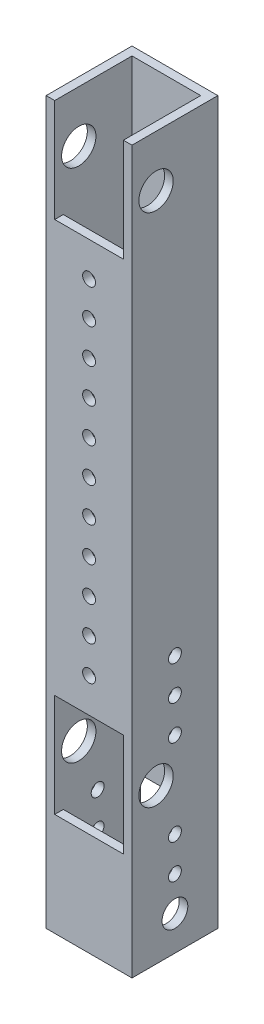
ISO-10303-21;
HEADER;
FILE_DESCRIPTION(('STEP AP214'),'2;1');
FILE_NAME('part.step','',(''),(''),'','','');
FILE_SCHEMA(('AUTOMOTIVE_DESIGN { 1 0 10303 214 1 1 1 1 }'));
ENDSEC;
DATA;
#1=APPLICATION_CONTEXT('core data for automotive mechanical design processes');
#2=APPLICATION_PROTOCOL_DEFINITION('international standard','automotive_design',2000,#1);
#3=PRODUCT_CONTEXT('',#1,'mechanical');
#4=PRODUCT('Part','Part','',(#3));
#5=PRODUCT_RELATED_PRODUCT_CATEGORY('part','',(#4));
#6=PRODUCT_DEFINITION_FORMATION('','',#4);
#7=PRODUCT_DEFINITION_CONTEXT('part definition',#1,'design');
#8=PRODUCT_DEFINITION('design','',#6,#7);
#9=PRODUCT_DEFINITION_SHAPE('','',#8);
#10=(LENGTH_UNIT() NAMED_UNIT(*) SI_UNIT(.MILLI.,.METRE.));
#11=(NAMED_UNIT(*) PLANE_ANGLE_UNIT() SI_UNIT($,.RADIAN.));
#12=(NAMED_UNIT(*) SI_UNIT($,.STERADIAN.) SOLID_ANGLE_UNIT());
#13=UNCERTAINTY_MEASURE_WITH_UNIT(LENGTH_MEASURE(1.E-05),#10,'distance_accuracy_value','');
#14=(GEOMETRIC_REPRESENTATION_CONTEXT(3) GLOBAL_UNCERTAINTY_ASSIGNED_CONTEXT((#13)) GLOBAL_UNIT_ASSIGNED_CONTEXT((#10,
#11,#12)) REPRESENTATION_CONTEXT('',''));
#15=CARTESIAN_POINT('',(0.,0.,0.));
#16=DIRECTION('',(0.,0.,1.));
#17=DIRECTION('',(1.,0.,0.));
#18=AXIS2_PLACEMENT_3D('',#15,#16,#17);
#19=CARTESIAN_POINT('',(15.875,266.7,15.875));
#20=DIRECTION('',(0.,0.,-1.));
#21=DIRECTION('',(-1.,0.,0.));
#22=AXIS2_PLACEMENT_3D('',#19,#20,#21);
#23=PLANE('',#22);
#24=CARTESIAN_POINT('',(6.66861918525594E-13,152.4,15.875));
#25=DIRECTION('',(0.,0.,1.));
#26=DIRECTION('',(1.,0.,0.));
#27=AXIS2_PLACEMENT_3D('',#24,#25,#26);
#28=CIRCLE('',#27,2.38125);
#29=CARTESIAN_POINT('',(2.38125000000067,152.4,15.875));
#30=VERTEX_POINT('',#29);
#31=EDGE_CURVE('E217',#30,#30,#28,.T.);
#32=ORIENTED_EDGE('',*,*,#31,.F.);
#33=EDGE_LOOP('',(#32));
#34=FACE_BOUND('',#33,.T.);
#35=CARTESIAN_POINT('',(7.99887357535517E-13,139.7,15.875));
#36=DIRECTION('',(0.,0.,1.));
#37=DIRECTION('',(1.,0.,0.));
#38=AXIS2_PLACEMENT_3D('',#35,#36,#37);
#39=CIRCLE('',#38,2.38125);
#40=CARTESIAN_POINT('',(2.3812500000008,139.7,15.875));
#41=VERTEX_POINT('',#40);
#42=EDGE_CURVE('E223',#41,#41,#39,.T.);
#43=ORIENTED_EDGE('',*,*,#42,.F.);
#44=EDGE_LOOP('',(#43));
#45=FACE_BOUND('',#44,.T.);
#46=CARTESIAN_POINT('',(9.32912796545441E-13,127.,15.875));
#47=DIRECTION('',(0.,0.,1.));
#48=DIRECTION('',(1.,0.,0.));
#49=AXIS2_PLACEMENT_3D('',#46,#47,#48);
#50=CIRCLE('',#49,2.38125000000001);
#51=CARTESIAN_POINT('',(2.38125000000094,127.,15.875));
#52=VERTEX_POINT('',#51);
#53=EDGE_CURVE('E229',#52,#52,#50,.T.);
#54=ORIENTED_EDGE('',*,*,#53,.F.);
#55=EDGE_LOOP('',(#54));
#56=FACE_BOUND('',#55,.T.);
#57=CARTESIAN_POINT('',(1.06593823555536E-12,114.3,15.875));
#58=DIRECTION('',(0.,0.,1.));
#59=DIRECTION('',(1.,0.,0.));
#60=AXIS2_PLACEMENT_3D('',#57,#58,#59);
#61=CIRCLE('',#60,2.38125);
#62=CARTESIAN_POINT('',(2.38125000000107,114.3,15.875));
#63=VERTEX_POINT('',#62);
#64=EDGE_CURVE('E235',#63,#63,#61,.T.);
#65=ORIENTED_EDGE('',*,*,#64,.F.);
#66=EDGE_LOOP('',(#65));
#67=FACE_BOUND('',#66,.T.);
#68=CARTESIAN_POINT('',(1.19896367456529E-12,101.6,15.875));
#69=DIRECTION('',(0.,0.,1.));
#70=DIRECTION('',(1.,0.,0.));
#71=AXIS2_PLACEMENT_3D('',#68,#69,#70);
#72=CIRCLE('',#71,2.38125);
#73=CARTESIAN_POINT('',(2.3812500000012,101.6,15.875));
#74=VERTEX_POINT('',#73);
#75=EDGE_CURVE('E241',#74,#74,#72,.T.);
#76=ORIENTED_EDGE('',*,*,#75,.F.);
#77=EDGE_LOOP('',(#76));
#78=FACE_BOUND('',#77,.T.);
#79=CARTESIAN_POINT('',(1.33198911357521E-12,88.8999999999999,15.875));
#80=DIRECTION('',(0.,0.,1.));
#81=DIRECTION('',(1.,0.,0.));
#82=AXIS2_PLACEMENT_3D('',#79,#80,#81);
#83=CIRCLE('',#82,2.38125);
#84=CARTESIAN_POINT('',(2.38125000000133,88.8999999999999,15.875));
#85=VERTEX_POINT('',#84);
#86=EDGE_CURVE('E247',#85,#85,#83,.T.);
#87=ORIENTED_EDGE('',*,*,#86,.F.);
#88=EDGE_LOOP('',(#87));
#89=FACE_BOUND('',#88,.T.);
#90=CARTESIAN_POINT('',(5.3383647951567E-13,165.1,15.875));
#91=DIRECTION('',(0.,0.,1.));
#92=DIRECTION('',(1.,0.,0.));
#93=AXIS2_PLACEMENT_3D('',#90,#91,#92);
#94=CIRCLE('',#93,2.38124999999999);
#95=CARTESIAN_POINT('',(2.38125000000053,165.1,15.875));
#96=VERTEX_POINT('',#95);
#97=EDGE_CURVE('E253',#96,#96,#94,.T.);
#98=ORIENTED_EDGE('',*,*,#97,.F.);
#99=EDGE_LOOP('',(#98));
#100=FACE_BOUND('',#99,.T.);
#101=CARTESIAN_POINT('',(4.00811040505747E-13,177.8,15.875));
#102=DIRECTION('',(0.,0.,1.));
#103=DIRECTION('',(1.,0.,0.));
#104=AXIS2_PLACEMENT_3D('',#101,#102,#103);
#105=CIRCLE('',#104,2.38125);
#106=CARTESIAN_POINT('',(2.3812500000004,177.8,15.875));
#107=VERTEX_POINT('',#106);
#108=EDGE_CURVE('E259',#107,#107,#105,.T.);
#109=ORIENTED_EDGE('',*,*,#108,.F.);
#110=EDGE_LOOP('',(#109));
#111=FACE_BOUND('',#110,.T.);
#112=CARTESIAN_POINT('',(2.67785601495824E-13,190.5,15.875));
#113=DIRECTION('',(0.,0.,1.));
#114=DIRECTION('',(1.,0.,0.));
#115=AXIS2_PLACEMENT_3D('',#112,#113,#114);
#116=CIRCLE('',#115,2.38125);
#117=CARTESIAN_POINT('',(2.38125000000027,190.5,15.875));
#118=VERTEX_POINT('',#117);
#119=EDGE_CURVE('E265',#118,#118,#116,.T.);
#120=ORIENTED_EDGE('',*,*,#119,.F.);
#121=EDGE_LOOP('',(#120));
#122=FACE_BOUND('',#121,.T.);
#123=CARTESIAN_POINT('',(1.347601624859E-13,203.2,15.875));
#124=DIRECTION('',(0.,0.,1.));
#125=DIRECTION('',(1.,0.,0.));
#126=AXIS2_PLACEMENT_3D('',#123,#124,#125);
#127=CIRCLE('',#126,2.38125);
#128=CARTESIAN_POINT('',(2.38125000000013,203.2,15.875));
#129=VERTEX_POINT('',#128);
#130=EDGE_CURVE('E271',#129,#129,#127,.T.);
#131=ORIENTED_EDGE('',*,*,#130,.F.);
#132=EDGE_LOOP('',(#131));
#133=FACE_BOUND('',#132,.T.);
#134=CARTESIAN_POINT('',(0.,215.9,15.875));
#135=DIRECTION('',(0.,0.,1.));
#136=DIRECTION('',(1.,0.,0.));
#137=AXIS2_PLACEMENT_3D('',#134,#135,#136);
#138=CIRCLE('',#137,2.38125);
#139=CARTESIAN_POINT('',(2.38125,215.9,15.875));
#140=VERTEX_POINT('',#139);
#141=EDGE_CURVE('E277',#140,#140,#138,.T.);
#142=ORIENTED_EDGE('',*,*,#141,.F.);
#143=EDGE_LOOP('',(#142));
#144=FACE_BOUND('',#143,.T.);
#145=DIRECTION('',(0.,1.,0.));
#146=VECTOR('',#145,1.);
#147=CARTESIAN_POINT('',(-12.7,0.,15.875));
#148=LINE('',#147,#146);
#149=CARTESIAN_POINT('',(-12.7,38.1,15.875));
#150=VERTEX_POINT('',#149);
#151=CARTESIAN_POINT('',(-12.7,76.2,15.875));
#152=VERTEX_POINT('',#151);
#153=EDGE_CURVE('E299',#150,#152,#148,.T.);
#154=ORIENTED_EDGE('',*,*,#153,.T.);
#155=DIRECTION('',(-1.,0.,0.));
#156=VECTOR('',#155,1.);
#157=CARTESIAN_POINT('',(0.,76.2,15.875));
#158=LINE('',#157,#156);
#159=CARTESIAN_POINT('',(12.7,76.2,15.875));
#160=VERTEX_POINT('',#159);
#161=EDGE_CURVE('E308',#160,#152,#158,.T.);
#162=ORIENTED_EDGE('',*,*,#161,.F.);
#163=DIRECTION('',(0.,1.,0.));
#164=VECTOR('',#163,1.);
#165=CARTESIAN_POINT('',(12.7,0.,15.875));
#166=LINE('',#165,#164);
#167=CARTESIAN_POINT('',(12.7,38.1,15.875));
#168=VERTEX_POINT('',#167);
#169=EDGE_CURVE('E305',#168,#160,#166,.T.);
#170=ORIENTED_EDGE('',*,*,#169,.F.);
#171=DIRECTION('',(-1.,0.,0.));
#172=VECTOR('',#171,1.);
#173=CARTESIAN_POINT('',(0.,38.1,15.875));
#174=LINE('',#173,#172);
#175=EDGE_CURVE('E302',#168,#150,#174,.T.);
#176=ORIENTED_EDGE('',*,*,#175,.T.);
#177=EDGE_LOOP('',(#154,#162,#170,#176));
#178=FACE_BOUND('',#177,.T.);
#179=DIRECTION('',(0.,1.,0.));
#180=VECTOR('',#179,1.);
#181=CARTESIAN_POINT('',(-12.7,0.,15.875));
#182=LINE('',#181,#180);
#183=CARTESIAN_POINT('',(-12.7,228.6,15.875));
#184=VERTEX_POINT('',#183);
#185=CARTESIAN_POINT('',(-12.7,266.7,15.875));
#186=VERTEX_POINT('',#185);
#187=EDGE_CURVE('E292',#184,#186,#182,.T.);
#188=ORIENTED_EDGE('',*,*,#187,.T.);
#189=DIRECTION('',(1.,0.,0.));
#190=VECTOR('',#189,1.);
#191=CARTESIAN_POINT('',(15.875,266.7,15.875));
#192=LINE('',#191,#190);
#193=CARTESIAN_POINT('',(-15.875,266.7,15.875));
#194=VERTEX_POINT('',#193);
#195=EDGE_CURVE('E449',#194,#186,#192,.T.);
#196=ORIENTED_EDGE('',*,*,#195,.F.);
#197=DIRECTION('',(0.,-1.,0.));
#198=VECTOR('',#197,1.);
#199=CARTESIAN_POINT('',(-15.875,266.7,15.875));
#200=LINE('',#199,#198);
#201=CARTESIAN_POINT('',(-15.875,0.,15.875));
#202=VERTEX_POINT('',#201);
#203=EDGE_CURVE('E474',#194,#202,#200,.T.);
#204=ORIENTED_EDGE('',*,*,#203,.T.);
#205=DIRECTION('',(1.,0.,0.));
#206=VECTOR('',#205,1.);
#207=CARTESIAN_POINT('',(15.875,0.,15.875));
#208=LINE('',#207,#206);
#209=CARTESIAN_POINT('',(15.875,0.,15.875));
#210=VERTEX_POINT('',#209);
#211=EDGE_CURVE('E459',#202,#210,#208,.T.);
#212=ORIENTED_EDGE('',*,*,#211,.T.);
#213=DIRECTION('',(0.,-1.,0.));
#214=VECTOR('',#213,1.);
#215=CARTESIAN_POINT('',(15.875,266.7,15.875));
#216=LINE('',#215,#214);
#217=CARTESIAN_POINT('',(15.875,266.7,15.875));
#218=VERTEX_POINT('',#217);
#219=EDGE_CURVE('E471',#218,#210,#216,.T.);
#220=ORIENTED_EDGE('',*,*,#219,.F.);
#221=CARTESIAN_POINT('',(12.7,266.7,15.875));
#222=VERTEX_POINT('',#221);
#223=EDGE_CURVE('E447',#222,#218,#192,.T.);
#224=ORIENTED_EDGE('',*,*,#223,.F.);
#225=DIRECTION('',(0.,1.,0.));
#226=VECTOR('',#225,1.);
#227=CARTESIAN_POINT('',(12.7,0.,15.875));
#228=LINE('',#227,#226);
#229=CARTESIAN_POINT('',(12.7,228.6,15.875));
#230=VERTEX_POINT('',#229);
#231=EDGE_CURVE('E285',#230,#222,#228,.T.);
#232=ORIENTED_EDGE('',*,*,#231,.F.);
#233=DIRECTION('',(-1.,0.,0.));
#234=VECTOR('',#233,1.);
#235=CARTESIAN_POINT('',(2.4980018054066E-13,228.6,15.875));
#236=LINE('',#235,#234);
#237=EDGE_CURVE('E288',#230,#184,#236,.T.);
#238=ORIENTED_EDGE('',*,*,#237,.T.);
#239=EDGE_LOOP('',(#188,#196,#204,#212,#220,#224,#232,#238));
#240=FACE_BOUND('',#239,.T.);
#241=ADVANCED_FACE('F39',(#34,#45,#56,#67,#78,#89,#100,#111,#122,#133,#144,#178,#240),#23,.F.);
#242=CARTESIAN_POINT('',(12.7,266.7,12.7));
#243=DIRECTION('',(0.,0.,-1.));
#244=DIRECTION('',(-1.,0.,0.));
#245=AXIS2_PLACEMENT_3D('',#242,#243,#244);
#246=PLANE('',#245);
#247=CARTESIAN_POINT('',(6.66861918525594E-13,152.4,12.7));
#248=DIRECTION('',(0.,0.,-1.));
#249=DIRECTION('',(-1.,0.,0.));
#250=AXIS2_PLACEMENT_3D('',#247,#248,#249);
#251=CIRCLE('',#250,2.38125);
#252=CARTESIAN_POINT('',(-2.38124999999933,152.4,12.7));
#253=VERTEX_POINT('',#252);
#254=EDGE_CURVE('E214',#253,#253,#251,.F.);
#255=ORIENTED_EDGE('',*,*,#254,.T.);
#256=EDGE_LOOP('',(#255));
#257=FACE_BOUND('',#256,.T.);
#258=CARTESIAN_POINT('',(7.99887357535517E-13,139.7,12.7));
#259=DIRECTION('',(0.,0.,-1.));
#260=DIRECTION('',(-1.,0.,0.));
#261=AXIS2_PLACEMENT_3D('',#258,#259,#260);
#262=CIRCLE('',#261,2.38125);
#263=CARTESIAN_POINT('',(-2.3812499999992,139.7,12.7));
#264=VERTEX_POINT('',#263);
#265=EDGE_CURVE('E220',#264,#264,#262,.F.);
#266=ORIENTED_EDGE('',*,*,#265,.T.);
#267=EDGE_LOOP('',(#266));
#268=FACE_BOUND('',#267,.T.);
#269=CARTESIAN_POINT('',(9.32912796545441E-13,127.,12.7));
#270=DIRECTION('',(0.,0.,-1.));
#271=DIRECTION('',(-1.,0.,0.));
#272=AXIS2_PLACEMENT_3D('',#269,#270,#271);
#273=CIRCLE('',#272,2.38125000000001);
#274=CARTESIAN_POINT('',(-2.38124999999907,127.,12.7));
#275=VERTEX_POINT('',#274);
#276=EDGE_CURVE('E226',#275,#275,#273,.F.);
#277=ORIENTED_EDGE('',*,*,#276,.T.);
#278=EDGE_LOOP('',(#277));
#279=FACE_BOUND('',#278,.T.);
#280=CARTESIAN_POINT('',(1.06593823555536E-12,114.3,12.7));
#281=DIRECTION('',(0.,0.,-1.));
#282=DIRECTION('',(-1.,0.,0.));
#283=AXIS2_PLACEMENT_3D('',#280,#281,#282);
#284=CIRCLE('',#283,2.38125);
#285=CARTESIAN_POINT('',(-2.38124999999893,114.3,12.7));
#286=VERTEX_POINT('',#285);
#287=EDGE_CURVE('E232',#286,#286,#284,.F.);
#288=ORIENTED_EDGE('',*,*,#287,.T.);
#289=EDGE_LOOP('',(#288));
#290=FACE_BOUND('',#289,.T.);
#291=CARTESIAN_POINT('',(1.19896367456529E-12,101.6,12.7));
#292=DIRECTION('',(0.,0.,-1.));
#293=DIRECTION('',(-1.,0.,0.));
#294=AXIS2_PLACEMENT_3D('',#291,#292,#293);
#295=CIRCLE('',#294,2.38125);
#296=CARTESIAN_POINT('',(-2.3812499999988,101.6,12.7));
#297=VERTEX_POINT('',#296);
#298=EDGE_CURVE('E238',#297,#297,#295,.F.);
#299=ORIENTED_EDGE('',*,*,#298,.T.);
#300=EDGE_LOOP('',(#299));
#301=FACE_BOUND('',#300,.T.);
#302=CARTESIAN_POINT('',(1.33198911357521E-12,88.8999999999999,12.7));
#303=DIRECTION('',(0.,0.,-1.));
#304=DIRECTION('',(-1.,0.,0.));
#305=AXIS2_PLACEMENT_3D('',#302,#303,#304);
#306=CIRCLE('',#305,2.38125);
#307=CARTESIAN_POINT('',(-2.38124999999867,88.8999999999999,12.7));
#308=VERTEX_POINT('',#307);
#309=EDGE_CURVE('E244',#308,#308,#306,.F.);
#310=ORIENTED_EDGE('',*,*,#309,.T.);
#311=EDGE_LOOP('',(#310));
#312=FACE_BOUND('',#311,.T.);
#313=CARTESIAN_POINT('',(5.3383647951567E-13,165.1,12.7));
#314=DIRECTION('',(0.,0.,-1.));
#315=DIRECTION('',(-1.,0.,0.));
#316=AXIS2_PLACEMENT_3D('',#313,#314,#315);
#317=CIRCLE('',#316,2.38124999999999);
#318=CARTESIAN_POINT('',(-2.38124999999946,165.1,12.7));
#319=VERTEX_POINT('',#318);
#320=EDGE_CURVE('E250',#319,#319,#317,.F.);
#321=ORIENTED_EDGE('',*,*,#320,.T.);
#322=EDGE_LOOP('',(#321));
#323=FACE_BOUND('',#322,.T.);
#324=CARTESIAN_POINT('',(4.00811040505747E-13,177.8,12.7));
#325=DIRECTION('',(0.,0.,-1.));
#326=DIRECTION('',(-1.,0.,0.));
#327=AXIS2_PLACEMENT_3D('',#324,#325,#326);
#328=CIRCLE('',#327,2.38125);
#329=CARTESIAN_POINT('',(-2.3812499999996,177.8,12.7));
#330=VERTEX_POINT('',#329);
#331=EDGE_CURVE('E256',#330,#330,#328,.F.);
#332=ORIENTED_EDGE('',*,*,#331,.T.);
#333=EDGE_LOOP('',(#332));
#334=FACE_BOUND('',#333,.T.);
#335=CARTESIAN_POINT('',(2.67785601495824E-13,190.5,12.7));
#336=DIRECTION('',(0.,0.,-1.));
#337=DIRECTION('',(-1.,0.,0.));
#338=AXIS2_PLACEMENT_3D('',#335,#336,#337);
#339=CIRCLE('',#338,2.38125);
#340=CARTESIAN_POINT('',(-2.38124999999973,190.5,12.7));
#341=VERTEX_POINT('',#340);
#342=EDGE_CURVE('E262',#341,#341,#339,.F.);
#343=ORIENTED_EDGE('',*,*,#342,.T.);
#344=EDGE_LOOP('',(#343));
#345=FACE_BOUND('',#344,.T.);
#346=CARTESIAN_POINT('',(1.347601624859E-13,203.2,12.7));
#347=DIRECTION('',(0.,0.,-1.));
#348=DIRECTION('',(-1.,0.,0.));
#349=AXIS2_PLACEMENT_3D('',#346,#347,#348);
#350=CIRCLE('',#349,2.38125);
#351=CARTESIAN_POINT('',(-2.38124999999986,203.2,12.7));
#352=VERTEX_POINT('',#351);
#353=EDGE_CURVE('E268',#352,#352,#350,.F.);
#354=ORIENTED_EDGE('',*,*,#353,.T.);
#355=EDGE_LOOP('',(#354));
#356=FACE_BOUND('',#355,.T.);
#357=CARTESIAN_POINT('',(0.,215.9,12.7));
#358=DIRECTION('',(0.,0.,-1.));
#359=DIRECTION('',(-1.,0.,0.));
#360=AXIS2_PLACEMENT_3D('',#357,#358,#359);
#361=CIRCLE('',#360,2.38125);
#362=CARTESIAN_POINT('',(-2.38125,215.9,12.7));
#363=VERTEX_POINT('',#362);
#364=EDGE_CURVE('E274',#363,#363,#361,.F.);
#365=ORIENTED_EDGE('',*,*,#364,.T.);
#366=EDGE_LOOP('',(#365));
#367=FACE_BOUND('',#366,.T.);
#368=DIRECTION('',(0.,-1.,0.));
#369=VECTOR('',#368,1.);
#370=CARTESIAN_POINT('',(-12.7,266.7,12.7));
#371=LINE('',#370,#369);
#372=CARTESIAN_POINT('',(-12.7,228.6,12.7));
#373=VERTEX_POINT('',#372);
#374=CARTESIAN_POINT('',(-12.7,76.2,12.7));
#375=VERTEX_POINT('',#374);
#376=EDGE_CURVE('E441',#373,#375,#371,.T.);
#377=ORIENTED_EDGE('',*,*,#376,.F.);
#378=DIRECTION('',(-1.,0.,0.));
#379=VECTOR('',#378,1.);
#380=CARTESIAN_POINT('',(2.4980018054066E-13,228.6,12.7));
#381=LINE('',#380,#379);
#382=CARTESIAN_POINT('',(12.7,228.6,12.7));
#383=VERTEX_POINT('',#382);
#384=EDGE_CURVE('E281',#383,#373,#381,.T.);
#385=ORIENTED_EDGE('',*,*,#384,.F.);
#386=DIRECTION('',(0.,-1.,0.));
#387=VECTOR('',#386,1.);
#388=CARTESIAN_POINT('',(12.7,266.7,12.7));
#389=LINE('',#388,#387);
#390=CARTESIAN_POINT('',(12.7,76.2,12.7));
#391=VERTEX_POINT('',#390);
#392=EDGE_CURVE('E438',#383,#391,#389,.T.);
#393=ORIENTED_EDGE('',*,*,#392,.T.);
#394=DIRECTION('',(-1.,0.,0.));
#395=VECTOR('',#394,1.);
#396=CARTESIAN_POINT('',(0.,76.2,12.7));
#397=LINE('',#396,#395);
#398=EDGE_CURVE('E284',#391,#375,#397,.T.);
#399=ORIENTED_EDGE('',*,*,#398,.T.);
#400=EDGE_LOOP('',(#377,#385,#393,#399));
#401=FACE_BOUND('',#400,.T.);
#402=ADVANCED_FACE('F570',(#257,#268,#279,#290,#301,#312,#323,#334,#345,#356,#367,#401),#246,.T.);
#403=CARTESIAN_POINT('',(0.,266.7,0.));
#404=DIRECTION('',(0.,1.,0.));
#405=DIRECTION('',(0.,0.,1.));
#406=AXIS2_PLACEMENT_3D('',#403,#404,#405);
#407=PLANE('',#406);
#408=ORIENTED_EDGE('',*,*,#195,.T.);
#409=DIRECTION('',(0.,0.,1.));
#410=VECTOR('',#409,1.);
#411=CARTESIAN_POINT('',(-12.7,266.7,12.7));
#412=LINE('',#411,#410);
#413=CARTESIAN_POINT('',(-12.7,266.7,-12.7));
#414=VERTEX_POINT('',#413);
#415=EDGE_CURVE('E417',#414,#186,#412,.T.);
#416=ORIENTED_EDGE('',*,*,#415,.F.);
#417=DIRECTION('',(-1.,0.,0.));
#418=VECTOR('',#417,1.);
#419=CARTESIAN_POINT('',(12.7,266.7,-12.7));
#420=LINE('',#419,#418);
#421=CARTESIAN_POINT('',(12.7,266.7,-12.7));
#422=VERTEX_POINT('',#421);
#423=EDGE_CURVE('E423',#422,#414,#420,.T.);
#424=ORIENTED_EDGE('',*,*,#423,.F.);
#425=DIRECTION('',(0.,0.,-1.));
#426=VECTOR('',#425,1.);
#427=CARTESIAN_POINT('',(12.7,266.7,12.7));
#428=LINE('',#427,#426);
#429=EDGE_CURVE('E419',#222,#422,#428,.T.);
#430=ORIENTED_EDGE('',*,*,#429,.F.);
#431=ORIENTED_EDGE('',*,*,#223,.T.);
#432=DIRECTION('',(0.,0.,-1.));
#433=VECTOR('',#432,1.);
#434=CARTESIAN_POINT('',(15.875,266.7,15.875));
#435=LINE('',#434,#433);
#436=CARTESIAN_POINT('',(15.875,266.7,-15.875));
#437=VERTEX_POINT('',#436);
#438=EDGE_CURVE('E452',#218,#437,#435,.T.);
#439=ORIENTED_EDGE('',*,*,#438,.T.);
#440=DIRECTION('',(-1.,0.,0.));
#441=VECTOR('',#440,1.);
#442=CARTESIAN_POINT('',(15.875,266.7,-15.875));
#443=LINE('',#442,#441);
#444=CARTESIAN_POINT('',(-15.875,266.7,-15.875));
#445=VERTEX_POINT('',#444);
#446=EDGE_CURVE('E454',#437,#445,#443,.T.);
#447=ORIENTED_EDGE('',*,*,#446,.T.);
#448=DIRECTION('',(0.,0.,1.));
#449=VECTOR('',#448,1.);
#450=CARTESIAN_POINT('',(-15.875,266.7,15.875));
#451=LINE('',#450,#449);
#452=EDGE_CURVE('E444',#445,#194,#451,.T.);
#453=ORIENTED_EDGE('',*,*,#452,.T.);
#454=EDGE_LOOP('',(#408,#416,#424,#430,#431,#439,#447,#453));
#455=FACE_BOUND('',#454,.T.);
#456=ADVANCED_FACE('F556',(#455),#407,.T.);
#457=CARTESIAN_POINT('',(-15.875,247.65,6.985));
#458=DIRECTION('',(1.,0.,0.));
#459=DIRECTION('',(0.,0.,-1.));
#460=AXIS2_PLACEMENT_3D('',#457,#458,#459);
#461=CYLINDRICAL_SURFACE('',#460,6.34999999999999);
#462=CARTESIAN_POINT('',(-15.875,247.65,6.985));
#463=DIRECTION('',(1.,0.,0.));
#464=DIRECTION('',(0.,0.,-1.));
#465=AXIS2_PLACEMENT_3D('',#462,#463,#464);
#466=CIRCLE('',#465,6.34999999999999);
#467=CARTESIAN_POINT('',(-15.875,247.65,0.635000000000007));
#468=VERTEX_POINT('',#467);
#469=EDGE_CURVE('E408',#468,#468,#466,.T.);
#470=ORIENTED_EDGE('',*,*,#469,.F.);
#471=EDGE_LOOP('',(#470));
#472=FACE_BOUND('',#471,.T.);
#473=CARTESIAN_POINT('',(-12.7,247.65,6.985));
#474=DIRECTION('',(1.,0.,0.));
#475=DIRECTION('',(0.,0.,-1.));
#476=AXIS2_PLACEMENT_3D('',#473,#474,#475);
#477=CIRCLE('',#476,6.34999999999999);
#478=CARTESIAN_POINT('',(-12.7,247.65,0.635000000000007));
#479=VERTEX_POINT('',#478);
#480=EDGE_CURVE('E411',#479,#479,#477,.T.);
#481=ORIENTED_EDGE('',*,*,#480,.T.);
#482=EDGE_LOOP('',(#481));
#483=FACE_BOUND('',#482,.T.);
#484=ADVANCED_FACE('F585',(#472,#483),#461,.F.);
#485=CARTESIAN_POINT('',(-12.7,38.1,12.7));
#486=VERTEX_POINT('',#485);
#487=CARTESIAN_POINT('',(-12.7,0.,12.7));
#488=VERTEX_POINT('',#487);
#489=EDGE_CURVE('E440',#486,#488,#371,.T.);
#490=ORIENTED_EDGE('',*,*,#489,.F.);
#491=DIRECTION('',(-1.,0.,0.));
#492=VECTOR('',#491,1.);
#493=CARTESIAN_POINT('',(0.,38.1,12.7));
#494=LINE('',#493,#492);
#495=CARTESIAN_POINT('',(12.7,38.1,12.7));
#496=VERTEX_POINT('',#495);
#497=EDGE_CURVE('E314',#496,#486,#494,.T.);
#498=ORIENTED_EDGE('',*,*,#497,.F.);
#499=CARTESIAN_POINT('',(12.7,0.,12.7));
#500=VERTEX_POINT('',#499);
#501=EDGE_CURVE('E437',#496,#500,#389,.T.);
#502=ORIENTED_EDGE('',*,*,#501,.T.);
#503=DIRECTION('',(1.,0.,0.));
#504=VECTOR('',#503,1.);
#505=CARTESIAN_POINT('',(12.7,0.,12.7));
#506=LINE('',#505,#504);
#507=EDGE_CURVE('E428',#488,#500,#506,.T.);
#508=ORIENTED_EDGE('',*,*,#507,.F.);
#509=EDGE_LOOP('',(#490,#498,#502,#508));
#510=FACE_BOUND('',#509,.T.);
#511=ADVANCED_FACE('F583',(#510),#246,.T.);
#512=CARTESIAN_POINT('',(-15.875,57.15,6.985));
#513=DIRECTION('',(1.,0.,0.));
#514=DIRECTION('',(0.,0.,-1.));
#515=AXIS2_PLACEMENT_3D('',#512,#513,#514);
#516=CYLINDRICAL_SURFACE('',#515,6.35);
#517=CARTESIAN_POINT('',(-15.875,57.15,6.985));
#518=DIRECTION('',(1.,0.,0.));
#519=DIRECTION('',(0.,0.,-1.));
#520=AXIS2_PLACEMENT_3D('',#517,#518,#519);
#521=CIRCLE('',#520,6.35);
#522=CARTESIAN_POINT('',(-15.875,57.15,0.635));
#523=VERTEX_POINT('',#522);
#524=EDGE_CURVE('E399',#523,#523,#521,.T.);
#525=ORIENTED_EDGE('',*,*,#524,.F.);
#526=EDGE_LOOP('',(#525));
#527=FACE_BOUND('',#526,.T.);
#528=CARTESIAN_POINT('',(-12.7,57.15,6.985));
#529=DIRECTION('',(1.,0.,0.));
#530=DIRECTION('',(0.,0.,-1.));
#531=AXIS2_PLACEMENT_3D('',#528,#529,#530);
#532=CIRCLE('',#531,6.35);
#533=CARTESIAN_POINT('',(-12.7,57.15,0.635));
#534=VERTEX_POINT('',#533);
#535=EDGE_CURVE('E402',#534,#534,#532,.T.);
#536=ORIENTED_EDGE('',*,*,#535,.T.);
#537=EDGE_LOOP('',(#536));
#538=FACE_BOUND('',#537,.T.);
#539=ADVANCED_FACE('F514',(#527,#538),#516,.F.);
#540=CARTESIAN_POINT('',(0.,0.,0.));
#541=DIRECTION('',(0.,1.,0.));
#542=DIRECTION('',(0.,0.,1.));
#543=AXIS2_PLACEMENT_3D('',#540,#541,#542);
#544=PLANE('',#543);
#545=DIRECTION('',(-1.,0.,0.));
#546=VECTOR('',#545,1.);
#547=CARTESIAN_POINT('',(15.875,0.,-15.875));
#548=LINE('',#547,#546);
#549=CARTESIAN_POINT('',(-12.7,0.,-15.875));
#550=VERTEX_POINT('',#549);
#551=CARTESIAN_POINT('',(-15.875,0.,-15.875));
#552=VERTEX_POINT('',#551);
#553=EDGE_CURVE('E463',#550,#552,#548,.T.);
#554=ORIENTED_EDGE('',*,*,#553,.F.);
#555=DIRECTION('',(0.,0.,1.));
#556=VECTOR('',#555,1.);
#557=CARTESIAN_POINT('',(-12.7,0.,12.7));
#558=LINE('',#557,#556);
#559=EDGE_CURVE('E416',#550,#488,#558,.T.);
#560=ORIENTED_EDGE('',*,*,#559,.T.);
#561=ORIENTED_EDGE('',*,*,#507,.T.);
#562=DIRECTION('',(0.,0.,-1.));
#563=VECTOR('',#562,1.);
#564=CARTESIAN_POINT('',(12.7,0.,12.7));
#565=LINE('',#564,#563);
#566=CARTESIAN_POINT('',(12.7,0.,-15.875));
#567=VERTEX_POINT('',#566);
#568=EDGE_CURVE('E420',#500,#567,#565,.T.);
#569=ORIENTED_EDGE('',*,*,#568,.T.);
#570=CARTESIAN_POINT('',(15.875,0.,-15.875));
#571=VERTEX_POINT('',#570);
#572=EDGE_CURVE('E448',#571,#567,#548,.T.);
#573=ORIENTED_EDGE('',*,*,#572,.F.);
#574=DIRECTION('',(0.,0.,-1.));
#575=VECTOR('',#574,1.);
#576=CARTESIAN_POINT('',(15.875,0.,15.875));
#577=LINE('',#576,#575);
#578=EDGE_CURVE('E461',#210,#571,#577,.T.);
#579=ORIENTED_EDGE('',*,*,#578,.F.);
#580=ORIENTED_EDGE('',*,*,#211,.F.);
#581=DIRECTION('',(0.,0.,1.));
#582=VECTOR('',#581,1.);
#583=CARTESIAN_POINT('',(-15.875,0.,15.875));
#584=LINE('',#583,#582);
#585=EDGE_CURVE('E443',#552,#202,#584,.T.);
#586=ORIENTED_EDGE('',*,*,#585,.F.);
#587=EDGE_LOOP('',(#554,#560,#561,#569,#573,#579,#580,#586));
#588=FACE_BOUND('',#587,.T.);
#589=ADVANCED_FACE('F537',(#588),#544,.F.);
#590=CARTESIAN_POINT('',(-15.875,266.7,15.875));
#591=DIRECTION('',(1.,0.,0.));
#592=DIRECTION('',(0.,0.,-1.));
#593=AXIS2_PLACEMENT_3D('',#590,#591,#592);
#594=PLANE('',#593);
#595=CARTESIAN_POINT('',(-15.875,95.25,0.));
#596=DIRECTION('',(1.,0.,0.));
#597=DIRECTION('',(0.,0.,-1.));
#598=AXIS2_PLACEMENT_3D('',#595,#596,#597);
#599=CIRCLE('',#598,2.38125);
#600=CARTESIAN_POINT('',(-15.875,95.25,-2.38125));
#601=VERTEX_POINT('',#600);
#602=EDGE_CURVE('E340',#601,#601,#599,.T.);
#603=ORIENTED_EDGE('',*,*,#602,.T.);
#604=EDGE_LOOP('',(#603));
#605=FACE_BOUND('',#604,.T.);
#606=CARTESIAN_POINT('',(-15.875,82.55,0.));
#607=DIRECTION('',(1.,0.,0.));
#608=DIRECTION('',(0.,0.,-1.));
#609=AXIS2_PLACEMENT_3D('',#606,#607,#608);
#610=CIRCLE('',#609,2.38125);
#611=CARTESIAN_POINT('',(-15.875,82.55,-2.38125));
#612=VERTEX_POINT('',#611);
#613=EDGE_CURVE('E349',#612,#612,#610,.T.);
#614=ORIENTED_EDGE('',*,*,#613,.T.);
#615=EDGE_LOOP('',(#614));
#616=FACE_BOUND('',#615,.T.);
#617=CARTESIAN_POINT('',(-15.875,69.85,0.));
#618=DIRECTION('',(1.,0.,0.));
#619=DIRECTION('',(0.,0.,-1.));
#620=AXIS2_PLACEMENT_3D('',#617,#618,#619);
#621=CIRCLE('',#620,2.38125);
#622=CARTESIAN_POINT('',(-15.875,69.85,-2.38125));
#623=VERTEX_POINT('',#622);
#624=EDGE_CURVE('E359',#623,#623,#621,.T.);
#625=ORIENTED_EDGE('',*,*,#624,.T.);
#626=EDGE_LOOP('',(#625));
#627=FACE_BOUND('',#626,.T.);
#628=CARTESIAN_POINT('',(-15.875,38.1,0.));
#629=DIRECTION('',(1.,0.,0.));
#630=DIRECTION('',(0.,0.,-1.));
#631=AXIS2_PLACEMENT_3D('',#628,#629,#630);
#632=CIRCLE('',#631,2.38125);
#633=CARTESIAN_POINT('',(-15.875,38.1,-2.38125));
#634=VERTEX_POINT('',#633);
#635=EDGE_CURVE('E369',#634,#634,#632,.T.);
#636=ORIENTED_EDGE('',*,*,#635,.T.);
#637=EDGE_LOOP('',(#636));
#638=FACE_BOUND('',#637,.T.);
#639=CARTESIAN_POINT('',(-15.875,25.4,0.));
#640=DIRECTION('',(1.,0.,0.));
#641=DIRECTION('',(0.,0.,-1.));
#642=AXIS2_PLACEMENT_3D('',#639,#640,#641);
#643=CIRCLE('',#642,2.38125);
#644=CARTESIAN_POINT('',(-15.875,25.4,-2.38125));
#645=VERTEX_POINT('',#644);
#646=EDGE_CURVE('E379',#645,#645,#643,.T.);
#647=ORIENTED_EDGE('',*,*,#646,.T.);
#648=EDGE_LOOP('',(#647));
#649=FACE_BOUND('',#648,.T.);
#650=CARTESIAN_POINT('',(-15.875,12.7,0.));
#651=DIRECTION('',(1.,0.,0.));
#652=DIRECTION('',(0.,0.,-1.));
#653=AXIS2_PLACEMENT_3D('',#650,#651,#652);
#654=CIRCLE('',#653,4.7625);
#655=CARTESIAN_POINT('',(-15.875,12.7,-4.7625));
#656=VERTEX_POINT('',#655);
#657=EDGE_CURVE('E389',#656,#656,#654,.T.);
#658=ORIENTED_EDGE('',*,*,#657,.T.);
#659=EDGE_LOOP('',(#658));
#660=FACE_BOUND('',#659,.T.);
#661=ORIENTED_EDGE('',*,*,#524,.T.);
#662=EDGE_LOOP('',(#661));
#663=FACE_BOUND('',#662,.T.);
#664=ORIENTED_EDGE('',*,*,#469,.T.);
#665=EDGE_LOOP('',(#664));
#666=FACE_BOUND('',#665,.T.);
#667=ORIENTED_EDGE('',*,*,#585,.T.);
#668=ORIENTED_EDGE('',*,*,#203,.F.);
#669=ORIENTED_EDGE('',*,*,#452,.F.);
#670=DIRECTION('',(0.,-1.,0.));
#671=VECTOR('',#670,1.);
#672=CARTESIAN_POINT('',(-15.875,266.7,-15.875));
#673=LINE('',#672,#671);
#674=EDGE_CURVE('E456',#445,#552,#673,.T.);
#675=ORIENTED_EDGE('',*,*,#674,.T.);
#676=EDGE_LOOP('',(#667,#668,#669,#675));
#677=FACE_BOUND('',#676,.T.);
#678=ADVANCED_FACE('F41',(#605,#616,#627,#638,#649,#660,#663,#666,#677),#594,.F.);
#679=CARTESIAN_POINT('',(15.875,266.7,15.875));
#680=DIRECTION('',(-1.,0.,0.));
#681=DIRECTION('',(0.,0.,1.));
#682=AXIS2_PLACEMENT_3D('',#679,#680,#681);
#683=PLANE('',#682);
#684=CARTESIAN_POINT('',(15.875,95.25,0.));
#685=DIRECTION('',(1.,0.,0.));
#686=DIRECTION('',(0.,0.,-1.));
#687=AXIS2_PLACEMENT_3D('',#684,#685,#686);
#688=CIRCLE('',#687,2.38125);
#689=CARTESIAN_POINT('',(15.875,95.25,-2.38125));
#690=VERTEX_POINT('',#689);
#691=EDGE_CURVE('E338',#690,#690,#688,.T.);
#692=ORIENTED_EDGE('',*,*,#691,.F.);
#693=EDGE_LOOP('',(#692));
#694=FACE_BOUND('',#693,.T.);
#695=CARTESIAN_POINT('',(15.875,82.55,0.));
#696=DIRECTION('',(1.,0.,0.));
#697=DIRECTION('',(0.,0.,-1.));
#698=AXIS2_PLACEMENT_3D('',#695,#696,#697);
#699=CIRCLE('',#698,2.38125);
#700=CARTESIAN_POINT('',(15.875,82.55,-2.38125));
#701=VERTEX_POINT('',#700);
#702=EDGE_CURVE('E348',#701,#701,#699,.T.);
#703=ORIENTED_EDGE('',*,*,#702,.F.);
#704=EDGE_LOOP('',(#703));
#705=FACE_BOUND('',#704,.T.);
#706=CARTESIAN_POINT('',(15.875,69.85,0.));
#707=DIRECTION('',(1.,0.,0.));
#708=DIRECTION('',(0.,0.,-1.));
#709=AXIS2_PLACEMENT_3D('',#706,#707,#708);
#710=CIRCLE('',#709,2.38125);
#711=CARTESIAN_POINT('',(15.875,69.85,-2.38125));
#712=VERTEX_POINT('',#711);
#713=EDGE_CURVE('E358',#712,#712,#710,.T.);
#714=ORIENTED_EDGE('',*,*,#713,.F.);
#715=EDGE_LOOP('',(#714));
#716=FACE_BOUND('',#715,.T.);
#717=CARTESIAN_POINT('',(15.875,38.1,0.));
#718=DIRECTION('',(1.,0.,0.));
#719=DIRECTION('',(0.,0.,-1.));
#720=AXIS2_PLACEMENT_3D('',#717,#718,#719);
#721=CIRCLE('',#720,2.38125);
#722=CARTESIAN_POINT('',(15.875,38.1,-2.38125));
#723=VERTEX_POINT('',#722);
#724=EDGE_CURVE('E368',#723,#723,#721,.T.);
#725=ORIENTED_EDGE('',*,*,#724,.F.);
#726=EDGE_LOOP('',(#725));
#727=FACE_BOUND('',#726,.T.);
#728=CARTESIAN_POINT('',(15.875,25.4,0.));
#729=DIRECTION('',(1.,0.,0.));
#730=DIRECTION('',(0.,0.,-1.));
#731=AXIS2_PLACEMENT_3D('',#728,#729,#730);
#732=CIRCLE('',#731,2.38125);
#733=CARTESIAN_POINT('',(15.875,25.4,-2.38125));
#734=VERTEX_POINT('',#733);
#735=EDGE_CURVE('E378',#734,#734,#732,.T.);
#736=ORIENTED_EDGE('',*,*,#735,.F.);
#737=EDGE_LOOP('',(#736));
#738=FACE_BOUND('',#737,.T.);
#739=CARTESIAN_POINT('',(15.875,12.7,0.));
#740=DIRECTION('',(1.,0.,0.));
#741=DIRECTION('',(0.,0.,-1.));
#742=AXIS2_PLACEMENT_3D('',#739,#740,#741);
#743=CIRCLE('',#742,4.7625);
#744=CARTESIAN_POINT('',(15.875,12.7,-4.7625));
#745=VERTEX_POINT('',#744);
#746=EDGE_CURVE('E388',#745,#745,#743,.T.);
#747=ORIENTED_EDGE('',*,*,#746,.F.);
#748=EDGE_LOOP('',(#747));
#749=FACE_BOUND('',#748,.T.);
#750=CARTESIAN_POINT('',(15.875,57.15,6.985));
#751=DIRECTION('',(1.,0.,0.));
#752=DIRECTION('',(0.,0.,-1.));
#753=AXIS2_PLACEMENT_3D('',#750,#751,#752);
#754=CIRCLE('',#753,6.35);
#755=CARTESIAN_POINT('',(15.875,57.15,0.635));
#756=VERTEX_POINT('',#755);
#757=EDGE_CURVE('E398',#756,#756,#754,.T.);
#758=ORIENTED_EDGE('',*,*,#757,.F.);
#759=EDGE_LOOP('',(#758));
#760=FACE_BOUND('',#759,.T.);
#761=CARTESIAN_POINT('',(15.875,247.65,6.985));
#762=DIRECTION('',(1.,0.,0.));
#763=DIRECTION('',(0.,0.,-1.));
#764=AXIS2_PLACEMENT_3D('',#761,#762,#763);
#765=CIRCLE('',#764,6.34999999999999);
#766=CARTESIAN_POINT('',(15.875,247.65,0.635000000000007));
#767=VERTEX_POINT('',#766);
#768=EDGE_CURVE('E407',#767,#767,#765,.T.);
#769=ORIENTED_EDGE('',*,*,#768,.F.);
#770=EDGE_LOOP('',(#769));
#771=FACE_BOUND('',#770,.T.);
#772=ORIENTED_EDGE('',*,*,#578,.T.);
#773=DIRECTION('',(0.,-1.,0.));
#774=VECTOR('',#773,1.);
#775=CARTESIAN_POINT('',(15.875,266.7,-15.875));
#776=LINE('',#775,#774);
#777=EDGE_CURVE('E468',#437,#571,#776,.T.);
#778=ORIENTED_EDGE('',*,*,#777,.F.);
#779=ORIENTED_EDGE('',*,*,#438,.F.);
#780=ORIENTED_EDGE('',*,*,#219,.T.);
#781=EDGE_LOOP('',(#772,#778,#779,#780));
#782=FACE_BOUND('',#781,.T.);
#783=ADVANCED_FACE('F517',(#694,#705,#716,#727,#738,#749,#760,#771,#782),#683,.F.);
#784=CARTESIAN_POINT('',(15.875,266.7,-15.875));
#785=DIRECTION('',(0.,0.,1.));
#786=DIRECTION('',(1.,0.,0.));
#787=AXIS2_PLACEMENT_3D('',#784,#785,#786);
#788=PLANE('',#787);
#789=CARTESIAN_POINT('',(0.,215.9,-15.875));
#790=DIRECTION('',(0.,0.,-1.));
#791=DIRECTION('',(-1.,0.,0.));
#792=AXIS2_PLACEMENT_3D('',#789,#790,#791);
#793=CIRCLE('',#792,8.5725);
#794=CARTESIAN_POINT('',(-8.5725,215.9,-15.875));
#795=VERTEX_POINT('',#794);
#796=CARTESIAN_POINT('',(8.5725,215.9,-15.875));
#797=VERTEX_POINT('',#796);
#798=EDGE_CURVE('E193',#795,#797,#793,.T.);
#799=ORIENTED_EDGE('',*,*,#798,.F.);
#800=DIRECTION('',(0.,1.,0.));
#801=VECTOR('',#800,1.);
#802=CARTESIAN_POINT('',(-8.5725,88.8999999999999,-15.875));
#803=LINE('',#802,#801);
#804=CARTESIAN_POINT('',(-8.5725,88.8999999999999,-15.875));
#805=VERTEX_POINT('',#804);
#806=EDGE_CURVE('E205',#805,#795,#803,.T.);
#807=ORIENTED_EDGE('',*,*,#806,.F.);
#808=CARTESIAN_POINT('',(1.33198911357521E-12,88.8999999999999,-15.875));
#809=DIRECTION('',(0.,0.,-1.));
#810=DIRECTION('',(-1.,0.,0.));
#811=AXIS2_PLACEMENT_3D('',#808,#809,#810);
#812=CIRCLE('',#811,8.5725);
#813=CARTESIAN_POINT('',(8.57250000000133,88.8999999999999,-15.875));
#814=VERTEX_POINT('',#813);
#815=EDGE_CURVE('E203',#814,#805,#812,.T.);
#816=ORIENTED_EDGE('',*,*,#815,.F.);
#817=DIRECTION('',(0.,-1.,0.));
#818=VECTOR('',#817,1.);
#819=CARTESIAN_POINT('',(8.5725,88.8999999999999,-15.875));
#820=LINE('',#819,#818);
#821=EDGE_CURVE('E56',#797,#814,#820,.T.);
#822=ORIENTED_EDGE('',*,*,#821,.F.);
#823=EDGE_LOOP('',(#799,#807,#816,#822));
#824=FACE_BOUND('',#823,.T.);
#825=DIRECTION('',(1.,0.,0.));
#826=VECTOR('',#825,1.);
#827=CARTESIAN_POINT('',(12.7,38.1,-15.875));
#828=LINE('',#827,#826);
#829=CARTESIAN_POINT('',(-12.7,38.1,-15.875));
#830=VERTEX_POINT('',#829);
#831=CARTESIAN_POINT('',(12.7,38.1,-15.875));
#832=VERTEX_POINT('',#831);
#833=EDGE_CURVE('E332',#830,#832,#828,.T.);
#834=ORIENTED_EDGE('',*,*,#833,.F.);
#835=DIRECTION('',(0.,1.,0.));
#836=VECTOR('',#835,1.);
#837=CARTESIAN_POINT('',(-12.7,0.,-15.875));
#838=LINE('',#837,#836);
#839=EDGE_CURVE('E329',#550,#830,#838,.T.);
#840=ORIENTED_EDGE('',*,*,#839,.F.);
#841=ORIENTED_EDGE('',*,*,#553,.T.);
#842=ORIENTED_EDGE('',*,*,#674,.F.);
#843=ORIENTED_EDGE('',*,*,#446,.F.);
#844=ORIENTED_EDGE('',*,*,#777,.T.);
#845=ORIENTED_EDGE('',*,*,#572,.T.);
#846=DIRECTION('',(0.,-1.,0.));
#847=VECTOR('',#846,1.);
#848=CARTESIAN_POINT('',(12.7,0.,-15.875));
#849=LINE('',#848,#847);
#850=EDGE_CURVE('E326',#832,#567,#849,.T.);
#851=ORIENTED_EDGE('',*,*,#850,.F.);
#852=EDGE_LOOP('',(#834,#840,#841,#842,#843,#844,#845,#851));
#853=FACE_BOUND('',#852,.T.);
#854=ADVANCED_FACE('F520',(#824,#853),#788,.F.);
#855=CARTESIAN_POINT('',(-12.7,266.7,12.7));
#856=DIRECTION('',(1.,0.,0.));
#857=DIRECTION('',(0.,0.,-1.));
#858=AXIS2_PLACEMENT_3D('',#855,#856,#857);
#859=PLANE('',#858);
#860=DIRECTION('',(0.,0.,1.));
#861=VECTOR('',#860,1.);
#862=CARTESIAN_POINT('',(-12.7,228.6,-15.876));
#863=LINE('',#862,#861);
#864=EDGE_CURVE('E280',#373,#184,#863,.T.);
#865=ORIENTED_EDGE('',*,*,#864,.F.);
#866=ORIENTED_EDGE('',*,*,#376,.T.);
#867=DIRECTION('',(0.,0.,1.));
#868=VECTOR('',#867,1.);
#869=CARTESIAN_POINT('',(-12.7,76.2,-15.876));
#870=LINE('',#869,#868);
#871=EDGE_CURVE('E312',#375,#152,#870,.T.);
#872=ORIENTED_EDGE('',*,*,#871,.T.);
#873=ORIENTED_EDGE('',*,*,#153,.F.);
#874=DIRECTION('',(0.,0.,1.));
#875=VECTOR('',#874,1.);
#876=CARTESIAN_POINT('',(-12.7,38.1,-15.876));
#877=LINE('',#876,#875);
#878=EDGE_CURVE('E311',#486,#150,#877,.T.);
#879=ORIENTED_EDGE('',*,*,#878,.F.);
#880=ORIENTED_EDGE('',*,*,#489,.T.);
#881=ORIENTED_EDGE('',*,*,#559,.F.);
#882=ORIENTED_EDGE('',*,*,#839,.T.);
#883=DIRECTION('',(0.,0.,-1.));
#884=VECTOR('',#883,1.);
#885=CARTESIAN_POINT('',(-12.7,38.1,15.876));
#886=LINE('',#885,#884);
#887=CARTESIAN_POINT('',(-12.7,38.1,-12.7));
#888=VERTEX_POINT('',#887);
#889=EDGE_CURVE('E335',#888,#830,#886,.T.);
#890=ORIENTED_EDGE('',*,*,#889,.F.);
#891=DIRECTION('',(0.,-1.,0.));
#892=VECTOR('',#891,1.);
#893=CARTESIAN_POINT('',(-12.7,266.7,-12.7));
#894=LINE('',#893,#892);
#895=EDGE_CURVE('E425',#414,#888,#894,.T.);
#896=ORIENTED_EDGE('',*,*,#895,.F.);
#897=ORIENTED_EDGE('',*,*,#415,.T.);
#898=ORIENTED_EDGE('',*,*,#187,.F.);
#899=EDGE_LOOP('',(#865,#866,#872,#873,#879,#880,#881,#882,#890,#896,#897,#898));
#900=FACE_BOUND('',#899,.T.);
#901=ORIENTED_EDGE('',*,*,#535,.F.);
#902=EDGE_LOOP('',(#901));
#903=FACE_BOUND('',#902,.T.);
#904=CARTESIAN_POINT('',(-12.7,95.25,0.));
#905=DIRECTION('',(1.,0.,0.));
#906=DIRECTION('',(0.,0.,-1.));
#907=AXIS2_PLACEMENT_3D('',#904,#905,#906);
#908=CIRCLE('',#907,2.38125);
#909=CARTESIAN_POINT('',(-12.7,95.25,-2.38125));
#910=VERTEX_POINT('',#909);
#911=EDGE_CURVE('E345',#910,#910,#908,.T.);
#912=ORIENTED_EDGE('',*,*,#911,.F.);
#913=EDGE_LOOP('',(#912));
#914=FACE_BOUND('',#913,.T.);
#915=CARTESIAN_POINT('',(-12.7,82.55,0.));
#916=DIRECTION('',(1.,0.,0.));
#917=DIRECTION('',(0.,0.,-1.));
#918=AXIS2_PLACEMENT_3D('',#915,#916,#917);
#919=CIRCLE('',#918,2.38125);
#920=CARTESIAN_POINT('',(-12.7,82.55,-2.38125));
#921=VERTEX_POINT('',#920);
#922=EDGE_CURVE('E355',#921,#921,#919,.T.);
#923=ORIENTED_EDGE('',*,*,#922,.F.);
#924=EDGE_LOOP('',(#923));
#925=FACE_BOUND('',#924,.T.);
#926=CARTESIAN_POINT('',(-12.7,69.85,0.));
#927=DIRECTION('',(1.,0.,0.));
#928=DIRECTION('',(0.,0.,-1.));
#929=AXIS2_PLACEMENT_3D('',#926,#927,#928);
#930=CIRCLE('',#929,2.38125);
#931=CARTESIAN_POINT('',(-12.7,69.85,-2.38125));
#932=VERTEX_POINT('',#931);
#933=EDGE_CURVE('E365',#932,#932,#930,.T.);
#934=ORIENTED_EDGE('',*,*,#933,.F.);
#935=EDGE_LOOP('',(#934));
#936=FACE_BOUND('',#935,.T.);
#937=CARTESIAN_POINT('',(-12.7,38.1,0.));
#938=DIRECTION('',(1.,0.,0.));
#939=DIRECTION('',(0.,0.,-1.));
#940=AXIS2_PLACEMENT_3D('',#937,#938,#939);
#941=CIRCLE('',#940,2.38125);
#942=CARTESIAN_POINT('',(-12.7,38.1,-2.38125));
#943=VERTEX_POINT('',#942);
#944=EDGE_CURVE('E375',#943,#943,#941,.T.);
#945=ORIENTED_EDGE('',*,*,#944,.F.);
#946=EDGE_LOOP('',(#945));
#947=FACE_BOUND('',#946,.T.);
#948=CARTESIAN_POINT('',(-12.7,25.4,0.));
#949=DIRECTION('',(1.,0.,0.));
#950=DIRECTION('',(0.,0.,-1.));
#951=AXIS2_PLACEMENT_3D('',#948,#949,#950);
#952=CIRCLE('',#951,2.38125);
#953=CARTESIAN_POINT('',(-12.7,25.4,-2.38125));
#954=VERTEX_POINT('',#953);
#955=EDGE_CURVE('E385',#954,#954,#952,.T.);
#956=ORIENTED_EDGE('',*,*,#955,.F.);
#957=EDGE_LOOP('',(#956));
#958=FACE_BOUND('',#957,.T.);
#959=CARTESIAN_POINT('',(-12.7,12.7,0.));
#960=DIRECTION('',(1.,0.,0.));
#961=DIRECTION('',(0.,0.,-1.));
#962=AXIS2_PLACEMENT_3D('',#959,#960,#961);
#963=CIRCLE('',#962,4.7625);
#964=CARTESIAN_POINT('',(-12.7,12.7,-4.7625));
#965=VERTEX_POINT('',#964);
#966=EDGE_CURVE('E395',#965,#965,#963,.T.);
#967=ORIENTED_EDGE('',*,*,#966,.F.);
#968=EDGE_LOOP('',(#967));
#969=FACE_BOUND('',#968,.T.);
#970=ORIENTED_EDGE('',*,*,#480,.F.);
#971=EDGE_LOOP('',(#970));
#972=FACE_BOUND('',#971,.T.);
#973=ADVANCED_FACE('F495',(#900,#903,#914,#925,#936,#947,#958,#969,#972),#859,.T.);
#974=CARTESIAN_POINT('',(12.7,266.7,12.7));
#975=DIRECTION('',(-1.,0.,0.));
#976=DIRECTION('',(0.,0.,1.));
#977=AXIS2_PLACEMENT_3D('',#974,#975,#976);
#978=PLANE('',#977);
#979=ORIENTED_EDGE('',*,*,#392,.F.);
#980=DIRECTION('',(0.,0.,1.));
#981=VECTOR('',#980,1.);
#982=CARTESIAN_POINT('',(12.7,228.6,-15.876));
#983=LINE('',#982,#981);
#984=EDGE_CURVE('E291',#383,#230,#983,.T.);
#985=ORIENTED_EDGE('',*,*,#984,.T.);
#986=ORIENTED_EDGE('',*,*,#231,.T.);
#987=ORIENTED_EDGE('',*,*,#429,.T.);
#988=DIRECTION('',(0.,-1.,0.));
#989=VECTOR('',#988,1.);
#990=CARTESIAN_POINT('',(12.7,266.7,-12.7));
#991=LINE('',#990,#989);
#992=CARTESIAN_POINT('',(12.7,38.1,-12.7));
#993=VERTEX_POINT('',#992);
#994=EDGE_CURVE('E434',#422,#993,#991,.T.);
#995=ORIENTED_EDGE('',*,*,#994,.T.);
#996=DIRECTION('',(0.,0.,-1.));
#997=VECTOR('',#996,1.);
#998=CARTESIAN_POINT('',(12.7,38.1,15.876));
#999=LINE('',#998,#997);
#1000=EDGE_CURVE('E336',#993,#832,#999,.T.);
#1001=ORIENTED_EDGE('',*,*,#1000,.T.);
#1002=ORIENTED_EDGE('',*,*,#850,.T.);
#1003=ORIENTED_EDGE('',*,*,#568,.F.);
#1004=ORIENTED_EDGE('',*,*,#501,.F.);
#1005=DIRECTION('',(0.,0.,1.));
#1006=VECTOR('',#1005,1.);
#1007=CARTESIAN_POINT('',(12.7,38.1,-15.876));
#1008=LINE('',#1007,#1006);
#1009=EDGE_CURVE('E317',#496,#168,#1008,.T.);
#1010=ORIENTED_EDGE('',*,*,#1009,.T.);
#1011=ORIENTED_EDGE('',*,*,#169,.T.);
#1012=DIRECTION('',(0.,0.,1.));
#1013=VECTOR('',#1012,1.);
#1014=CARTESIAN_POINT('',(12.7,76.2,-15.876));
#1015=LINE('',#1014,#1013);
#1016=EDGE_CURVE('E315',#391,#160,#1015,.T.);
#1017=ORIENTED_EDGE('',*,*,#1016,.F.);
#1018=EDGE_LOOP('',(#979,#985,#986,#987,#995,#1001,#1002,#1003,#1004,#1010,#1011,#1017));
#1019=FACE_BOUND('',#1018,.T.);
#1020=CARTESIAN_POINT('',(12.7,247.65,6.985));
#1021=DIRECTION('',(-1.,0.,0.));
#1022=DIRECTION('',(0.,0.,1.));
#1023=AXIS2_PLACEMENT_3D('',#1020,#1021,#1022);
#1024=CIRCLE('',#1023,6.34999999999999);
#1025=CARTESIAN_POINT('',(12.7,247.65,13.335));
#1026=VERTEX_POINT('',#1025);
#1027=EDGE_CURVE('E48',#1026,#1026,#1024,.T.);
#1028=ORIENTED_EDGE('',*,*,#1027,.F.);
#1029=EDGE_LOOP('',(#1028));
#1030=FACE_BOUND('',#1029,.T.);
#1031=CARTESIAN_POINT('',(12.7,95.25,0.));
#1032=DIRECTION('',(-1.,0.,0.));
#1033=DIRECTION('',(0.,0.,1.));
#1034=AXIS2_PLACEMENT_3D('',#1031,#1032,#1033);
#1035=CIRCLE('',#1034,2.38125);
#1036=CARTESIAN_POINT('',(12.7,95.25,2.38125));
#1037=VERTEX_POINT('',#1036);
#1038=EDGE_CURVE('E43',#1037,#1037,#1035,.T.);
#1039=ORIENTED_EDGE('',*,*,#1038,.F.);
#1040=EDGE_LOOP('',(#1039));
#1041=FACE_BOUND('',#1040,.T.);
#1042=CARTESIAN_POINT('',(12.7,82.55,0.));
#1043=DIRECTION('',(-1.,0.,0.));
#1044=DIRECTION('',(0.,0.,1.));
#1045=AXIS2_PLACEMENT_3D('',#1042,#1043,#1044);
#1046=CIRCLE('',#1045,2.38125);
#1047=CARTESIAN_POINT('',(12.7,82.55,2.38125));
#1048=VERTEX_POINT('',#1047);
#1049=EDGE_CURVE('E352',#1048,#1048,#1046,.T.);
#1050=ORIENTED_EDGE('',*,*,#1049,.F.);
#1051=EDGE_LOOP('',(#1050));
#1052=FACE_BOUND('',#1051,.T.);
#1053=CARTESIAN_POINT('',(12.7,69.85,0.));
#1054=DIRECTION('',(-1.,0.,0.));
#1055=DIRECTION('',(0.,0.,1.));
#1056=AXIS2_PLACEMENT_3D('',#1053,#1054,#1055);
#1057=CIRCLE('',#1056,2.38125);
#1058=CARTESIAN_POINT('',(12.7,69.85,2.38125));
#1059=VERTEX_POINT('',#1058);
#1060=EDGE_CURVE('E362',#1059,#1059,#1057,.T.);
#1061=ORIENTED_EDGE('',*,*,#1060,.F.);
#1062=EDGE_LOOP('',(#1061));
#1063=FACE_BOUND('',#1062,.T.);
#1064=CARTESIAN_POINT('',(12.7,38.1,0.));
#1065=DIRECTION('',(-1.,0.,0.));
#1066=DIRECTION('',(0.,0.,1.));
#1067=AXIS2_PLACEMENT_3D('',#1064,#1065,#1066);
#1068=CIRCLE('',#1067,2.38125);
#1069=CARTESIAN_POINT('',(12.7,38.1,2.38125));
#1070=VERTEX_POINT('',#1069);
#1071=EDGE_CURVE('E372',#1070,#1070,#1068,.T.);
#1072=ORIENTED_EDGE('',*,*,#1071,.F.);
#1073=EDGE_LOOP('',(#1072));
#1074=FACE_BOUND('',#1073,.T.);
#1075=CARTESIAN_POINT('',(12.7,25.4,0.));
#1076=DIRECTION('',(-1.,0.,0.));
#1077=DIRECTION('',(0.,0.,1.));
#1078=AXIS2_PLACEMENT_3D('',#1075,#1076,#1077);
#1079=CIRCLE('',#1078,2.38125);
#1080=CARTESIAN_POINT('',(12.7,25.4,2.38125));
#1081=VERTEX_POINT('',#1080);
#1082=EDGE_CURVE('E382',#1081,#1081,#1079,.T.);
#1083=ORIENTED_EDGE('',*,*,#1082,.F.);
#1084=EDGE_LOOP('',(#1083));
#1085=FACE_BOUND('',#1084,.T.);
#1086=CARTESIAN_POINT('',(12.7,12.7,0.));
#1087=DIRECTION('',(-1.,0.,0.));
#1088=DIRECTION('',(0.,0.,1.));
#1089=AXIS2_PLACEMENT_3D('',#1086,#1087,#1088);
#1090=CIRCLE('',#1089,4.7625);
#1091=CARTESIAN_POINT('',(12.7,12.7,4.7625));
#1092=VERTEX_POINT('',#1091);
#1093=EDGE_CURVE('E392',#1092,#1092,#1090,.T.);
#1094=ORIENTED_EDGE('',*,*,#1093,.F.);
#1095=EDGE_LOOP('',(#1094));
#1096=FACE_BOUND('',#1095,.T.);
#1097=CARTESIAN_POINT('',(12.7,57.15,6.985));
#1098=DIRECTION('',(-1.,0.,0.));
#1099=DIRECTION('',(0.,0.,1.));
#1100=AXIS2_PLACEMENT_3D('',#1097,#1098,#1099);
#1101=CIRCLE('',#1100,6.35);
#1102=CARTESIAN_POINT('',(12.7,57.15,13.335));
#1103=VERTEX_POINT('',#1102);
#1104=EDGE_CURVE('E11',#1103,#1103,#1101,.T.);
#1105=ORIENTED_EDGE('',*,*,#1104,.F.);
#1106=EDGE_LOOP('',(#1105));
#1107=FACE_BOUND('',#1106,.T.);
#1108=ADVANCED_FACE('F492',(#1019,#1030,#1041,#1052,#1063,#1074,#1085,#1096,#1107),#978,.T.);
#1109=CARTESIAN_POINT('',(12.7,266.7,-12.7));
#1110=DIRECTION('',(0.,0.,1.));
#1111=DIRECTION('',(1.,0.,0.));
#1112=AXIS2_PLACEMENT_3D('',#1109,#1110,#1111);
#1113=PLANE('',#1112);
#1114=DIRECTION('',(0.,1.,0.));
#1115=VECTOR('',#1114,1.);
#1116=CARTESIAN_POINT('',(-8.5725,88.8999999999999,-12.7));
#1117=LINE('',#1116,#1115);
#1118=CARTESIAN_POINT('',(-8.57249999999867,88.8999999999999,-12.7));
#1119=VERTEX_POINT('',#1118);
#1120=CARTESIAN_POINT('',(-8.5725,215.9,-12.7));
#1121=VERTEX_POINT('',#1120);
#1122=EDGE_CURVE('E199',#1119,#1121,#1117,.T.);
#1123=ORIENTED_EDGE('',*,*,#1122,.T.);
#1124=CARTESIAN_POINT('',(0.,215.9,-12.7));
#1125=DIRECTION('',(0.,0.,1.));
#1126=DIRECTION('',(1.,0.,0.));
#1127=AXIS2_PLACEMENT_3D('',#1124,#1125,#1126);
#1128=CIRCLE('',#1127,8.5725);
#1129=CARTESIAN_POINT('',(8.5725,215.9,-12.7));
#1130=VERTEX_POINT('',#1129);
#1131=EDGE_CURVE('E187',#1121,#1130,#1128,.F.);
#1132=ORIENTED_EDGE('',*,*,#1131,.T.);
#1133=DIRECTION('',(0.,-1.,0.));
#1134=VECTOR('',#1133,1.);
#1135=CARTESIAN_POINT('',(8.5725,88.8999999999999,-12.7));
#1136=LINE('',#1135,#1134);
#1137=CARTESIAN_POINT('',(8.5725,88.8999999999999,-12.7));
#1138=VERTEX_POINT('',#1137);
#1139=EDGE_CURVE('E177',#1130,#1138,#1136,.T.);
#1140=ORIENTED_EDGE('',*,*,#1139,.T.);
#1141=CARTESIAN_POINT('',(1.33198911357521E-12,88.8999999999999,-12.7));
#1142=DIRECTION('',(0.,0.,1.));
#1143=DIRECTION('',(1.,0.,0.));
#1144=AXIS2_PLACEMENT_3D('',#1141,#1142,#1143);
#1145=CIRCLE('',#1144,8.5725);
#1146=EDGE_CURVE('E186',#1138,#1119,#1145,.F.);
#1147=ORIENTED_EDGE('',*,*,#1146,.T.);
#1148=EDGE_LOOP('',(#1123,#1132,#1140,#1147));
#1149=FACE_BOUND('',#1148,.T.);
#1150=DIRECTION('',(1.,0.,0.));
#1151=VECTOR('',#1150,1.);
#1152=CARTESIAN_POINT('',(12.7,38.1,-12.7));
#1153=LINE('',#1152,#1151);
#1154=EDGE_CURVE('E323',#888,#993,#1153,.T.);
#1155=ORIENTED_EDGE('',*,*,#1154,.T.);
#1156=ORIENTED_EDGE('',*,*,#994,.F.);
#1157=ORIENTED_EDGE('',*,*,#423,.T.);
#1158=ORIENTED_EDGE('',*,*,#895,.T.);
#1159=EDGE_LOOP('',(#1155,#1156,#1157,#1158));
#1160=FACE_BOUND('',#1159,.T.);
#1161=ADVANCED_FACE('F197',(#1149,#1160),#1113,.T.);
#1162=ORIENTED_EDGE('',*,*,#1027,.T.);
#1163=EDGE_LOOP('',(#1162));
#1164=FACE_BOUND('',#1163,.T.);
#1165=ORIENTED_EDGE('',*,*,#768,.T.);
#1166=EDGE_LOOP('',(#1165));
#1167=FACE_BOUND('',#1166,.T.);
#1168=ADVANCED_FACE('F512',(#1164,#1167),#461,.F.);
#1169=ORIENTED_EDGE('',*,*,#1104,.T.);
#1170=EDGE_LOOP('',(#1169));
#1171=FACE_BOUND('',#1170,.T.);
#1172=ORIENTED_EDGE('',*,*,#757,.T.);
#1173=EDGE_LOOP('',(#1172));
#1174=FACE_BOUND('',#1173,.T.);
#1175=ADVANCED_FACE('F508',(#1171,#1174),#516,.F.);
#1176=CARTESIAN_POINT('',(-15.875,12.7,0.));
#1177=DIRECTION('',(1.,0.,0.));
#1178=DIRECTION('',(0.,0.,-1.));
#1179=AXIS2_PLACEMENT_3D('',#1176,#1177,#1178);
#1180=CYLINDRICAL_SURFACE('',#1179,4.7625);
#1181=ORIENTED_EDGE('',*,*,#1093,.T.);
#1182=EDGE_LOOP('',(#1181));
#1183=FACE_BOUND('',#1182,.T.);
#1184=ORIENTED_EDGE('',*,*,#746,.T.);
#1185=EDGE_LOOP('',(#1184));
#1186=FACE_BOUND('',#1185,.T.);
#1187=ADVANCED_FACE('F511',(#1183,#1186),#1180,.F.);
#1188=ORIENTED_EDGE('',*,*,#966,.T.);
#1189=EDGE_LOOP('',(#1188));
#1190=FACE_BOUND('',#1189,.T.);
#1191=ORIENTED_EDGE('',*,*,#657,.F.);
#1192=EDGE_LOOP('',(#1191));
#1193=FACE_BOUND('',#1192,.T.);
#1194=ADVANCED_FACE('F648',(#1190,#1193),#1180,.F.);
#1195=CARTESIAN_POINT('',(-15.875,25.4,0.));
#1196=DIRECTION('',(1.,0.,0.));
#1197=DIRECTION('',(0.,0.,-1.));
#1198=AXIS2_PLACEMENT_3D('',#1195,#1196,#1197);
#1199=CYLINDRICAL_SURFACE('',#1198,2.38125);
#1200=ORIENTED_EDGE('',*,*,#1082,.T.);
#1201=EDGE_LOOP('',(#1200));
#1202=FACE_BOUND('',#1201,.T.);
#1203=ORIENTED_EDGE('',*,*,#735,.T.);
#1204=EDGE_LOOP('',(#1203));
#1205=FACE_BOUND('',#1204,.T.);
#1206=ADVANCED_FACE('F657',(#1202,#1205),#1199,.F.);
#1207=ORIENTED_EDGE('',*,*,#955,.T.);
#1208=EDGE_LOOP('',(#1207));
#1209=FACE_BOUND('',#1208,.T.);
#1210=ORIENTED_EDGE('',*,*,#646,.F.);
#1211=EDGE_LOOP('',(#1210));
#1212=FACE_BOUND('',#1211,.T.);
#1213=ADVANCED_FACE('F664',(#1209,#1212),#1199,.F.);
#1214=CARTESIAN_POINT('',(-15.875,38.1,0.));
#1215=DIRECTION('',(1.,0.,0.));
#1216=DIRECTION('',(0.,0.,-1.));
#1217=AXIS2_PLACEMENT_3D('',#1214,#1215,#1216);
#1218=CYLINDRICAL_SURFACE('',#1217,2.38125);
#1219=ORIENTED_EDGE('',*,*,#1071,.T.);
#1220=EDGE_LOOP('',(#1219));
#1221=FACE_BOUND('',#1220,.T.);
#1222=ORIENTED_EDGE('',*,*,#724,.T.);
#1223=EDGE_LOOP('',(#1222));
#1224=FACE_BOUND('',#1223,.T.);
#1225=ADVANCED_FACE('F672',(#1221,#1224),#1218,.F.);
#1226=ORIENTED_EDGE('',*,*,#944,.T.);
#1227=EDGE_LOOP('',(#1226));
#1228=FACE_BOUND('',#1227,.T.);
#1229=ORIENTED_EDGE('',*,*,#635,.F.);
#1230=EDGE_LOOP('',(#1229));
#1231=FACE_BOUND('',#1230,.T.);
#1232=ADVANCED_FACE('F679',(#1228,#1231),#1218,.F.);
#1233=CARTESIAN_POINT('',(-15.875,69.85,0.));
#1234=DIRECTION('',(1.,0.,0.));
#1235=DIRECTION('',(0.,0.,-1.));
#1236=AXIS2_PLACEMENT_3D('',#1233,#1234,#1235);
#1237=CYLINDRICAL_SURFACE('',#1236,2.38125);
#1238=ORIENTED_EDGE('',*,*,#1060,.T.);
#1239=EDGE_LOOP('',(#1238));
#1240=FACE_BOUND('',#1239,.T.);
#1241=ORIENTED_EDGE('',*,*,#713,.T.);
#1242=EDGE_LOOP('',(#1241));
#1243=FACE_BOUND('',#1242,.T.);
#1244=ADVANCED_FACE('F687',(#1240,#1243),#1237,.F.);
#1245=ORIENTED_EDGE('',*,*,#933,.T.);
#1246=EDGE_LOOP('',(#1245));
#1247=FACE_BOUND('',#1246,.T.);
#1248=ORIENTED_EDGE('',*,*,#624,.F.);
#1249=EDGE_LOOP('',(#1248));
#1250=FACE_BOUND('',#1249,.T.);
#1251=ADVANCED_FACE('F694',(#1247,#1250),#1237,.F.);
#1252=CARTESIAN_POINT('',(-15.875,82.55,0.));
#1253=DIRECTION('',(1.,0.,0.));
#1254=DIRECTION('',(0.,0.,-1.));
#1255=AXIS2_PLACEMENT_3D('',#1252,#1253,#1254);
#1256=CYLINDRICAL_SURFACE('',#1255,2.38125);
#1257=ORIENTED_EDGE('',*,*,#1049,.T.);
#1258=EDGE_LOOP('',(#1257));
#1259=FACE_BOUND('',#1258,.T.);
#1260=ORIENTED_EDGE('',*,*,#702,.T.);
#1261=EDGE_LOOP('',(#1260));
#1262=FACE_BOUND('',#1261,.T.);
#1263=ADVANCED_FACE('F489',(#1259,#1262),#1256,.F.);
#1264=ORIENTED_EDGE('',*,*,#922,.T.);
#1265=EDGE_LOOP('',(#1264));
#1266=FACE_BOUND('',#1265,.T.);
#1267=ORIENTED_EDGE('',*,*,#613,.F.);
#1268=EDGE_LOOP('',(#1267));
#1269=FACE_BOUND('',#1268,.T.);
#1270=ADVANCED_FACE('F708',(#1266,#1269),#1256,.F.);
#1271=CARTESIAN_POINT('',(-15.875,95.25,0.));
#1272=DIRECTION('',(1.,0.,0.));
#1273=DIRECTION('',(0.,0.,-1.));
#1274=AXIS2_PLACEMENT_3D('',#1271,#1272,#1273);
#1275=CYLINDRICAL_SURFACE('',#1274,2.38125);
#1276=ORIENTED_EDGE('',*,*,#1038,.T.);
#1277=EDGE_LOOP('',(#1276));
#1278=FACE_BOUND('',#1277,.T.);
#1279=ORIENTED_EDGE('',*,*,#691,.T.);
#1280=EDGE_LOOP('',(#1279));
#1281=FACE_BOUND('',#1280,.T.);
#1282=ADVANCED_FACE('F715',(#1278,#1281),#1275,.F.);
#1283=ORIENTED_EDGE('',*,*,#911,.T.);
#1284=EDGE_LOOP('',(#1283));
#1285=FACE_BOUND('',#1284,.T.);
#1286=ORIENTED_EDGE('',*,*,#602,.F.);
#1287=EDGE_LOOP('',(#1286));
#1288=FACE_BOUND('',#1287,.T.);
#1289=ADVANCED_FACE('F722',(#1285,#1288),#1275,.F.);
#1290=CARTESIAN_POINT('',(12.7,38.1,15.876));
#1291=DIRECTION('',(0.,1.,0.));
#1292=DIRECTION('',(0.,0.,1.));
#1293=AXIS2_PLACEMENT_3D('',#1290,#1291,#1292);
#1294=PLANE('',#1293);
#1295=ORIENTED_EDGE('',*,*,#889,.T.);
#1296=ORIENTED_EDGE('',*,*,#833,.T.);
#1297=ORIENTED_EDGE('',*,*,#1000,.F.);
#1298=ORIENTED_EDGE('',*,*,#1154,.F.);
#1299=EDGE_LOOP('',(#1295,#1296,#1297,#1298));
#1300=FACE_BOUND('',#1299,.T.);
#1301=ADVANCED_FACE('F545',(#1300),#1294,.F.);
#1302=CARTESIAN_POINT('',(0.,76.2,-15.876));
#1303=DIRECTION('',(0.,1.,0.));
#1304=DIRECTION('',(0.,0.,1.));
#1305=AXIS2_PLACEMENT_3D('',#1302,#1303,#1304);
#1306=PLANE('',#1305);
#1307=ORIENTED_EDGE('',*,*,#1016,.T.);
#1308=ORIENTED_EDGE('',*,*,#161,.T.);
#1309=ORIENTED_EDGE('',*,*,#871,.F.);
#1310=ORIENTED_EDGE('',*,*,#398,.F.);
#1311=EDGE_LOOP('',(#1307,#1308,#1309,#1310));
#1312=FACE_BOUND('',#1311,.T.);
#1313=ADVANCED_FACE('F574',(#1312),#1306,.F.);
#1314=CARTESIAN_POINT('',(0.,38.1,-15.876));
#1315=DIRECTION('',(0.,1.,0.));
#1316=DIRECTION('',(-1.,0.,0.));
#1317=AXIS2_PLACEMENT_3D('',#1314,#1315,#1316);
#1318=PLANE('',#1317);
#1319=ORIENTED_EDGE('',*,*,#497,.T.);
#1320=ORIENTED_EDGE('',*,*,#878,.T.);
#1321=ORIENTED_EDGE('',*,*,#175,.F.);
#1322=ORIENTED_EDGE('',*,*,#1009,.F.);
#1323=EDGE_LOOP('',(#1319,#1320,#1321,#1322));
#1324=FACE_BOUND('',#1323,.T.);
#1325=ADVANCED_FACE('F580',(#1324),#1318,.T.);
#1326=CARTESIAN_POINT('',(2.4980018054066E-13,228.6,-15.876));
#1327=DIRECTION('',(0.,1.,0.));
#1328=DIRECTION('',(-1.,0.,0.));
#1329=AXIS2_PLACEMENT_3D('',#1326,#1327,#1328);
#1330=PLANE('',#1329);
#1331=ORIENTED_EDGE('',*,*,#384,.T.);
#1332=ORIENTED_EDGE('',*,*,#864,.T.);
#1333=ORIENTED_EDGE('',*,*,#237,.F.);
#1334=ORIENTED_EDGE('',*,*,#984,.F.);
#1335=EDGE_LOOP('',(#1331,#1332,#1333,#1334));
#1336=FACE_BOUND('',#1335,.T.);
#1337=ADVANCED_FACE('F567',(#1336),#1330,.T.);
#1338=CARTESIAN_POINT('',(0.,215.9,-15.876));
#1339=DIRECTION('',(0.,0.,1.));
#1340=DIRECTION('',(1.,0.,0.));
#1341=AXIS2_PLACEMENT_3D('',#1338,#1339,#1340);
#1342=CYLINDRICAL_SURFACE('',#1341,2.38125);
#1343=ORIENTED_EDGE('',*,*,#364,.F.);
#1344=EDGE_LOOP('',(#1343));
#1345=FACE_BOUND('',#1344,.T.);
#1346=ORIENTED_EDGE('',*,*,#141,.T.);
#1347=EDGE_LOOP('',(#1346));
#1348=FACE_BOUND('',#1347,.T.);
#1349=ADVANCED_FACE('F754',(#1345,#1348),#1342,.F.);
#1350=CARTESIAN_POINT('',(1.347601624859E-13,203.2,-15.876));
#1351=DIRECTION('',(0.,0.,1.));
#1352=DIRECTION('',(1.,0.,0.));
#1353=AXIS2_PLACEMENT_3D('',#1350,#1351,#1352);
#1354=CYLINDRICAL_SURFACE('',#1353,2.38125);
#1355=ORIENTED_EDGE('',*,*,#353,.F.);
#1356=EDGE_LOOP('',(#1355));
#1357=FACE_BOUND('',#1356,.T.);
#1358=ORIENTED_EDGE('',*,*,#130,.T.);
#1359=EDGE_LOOP('',(#1358));
#1360=FACE_BOUND('',#1359,.T.);
#1361=ADVANCED_FACE('F761',(#1357,#1360),#1354,.F.);
#1362=CARTESIAN_POINT('',(2.67785601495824E-13,190.5,-15.876));
#1363=DIRECTION('',(0.,0.,1.));
#1364=DIRECTION('',(1.,0.,0.));
#1365=AXIS2_PLACEMENT_3D('',#1362,#1363,#1364);
#1366=CYLINDRICAL_SURFACE('',#1365,2.38125);
#1367=ORIENTED_EDGE('',*,*,#342,.F.);
#1368=EDGE_LOOP('',(#1367));
#1369=FACE_BOUND('',#1368,.T.);
#1370=ORIENTED_EDGE('',*,*,#119,.T.);
#1371=EDGE_LOOP('',(#1370));
#1372=FACE_BOUND('',#1371,.T.);
#1373=ADVANCED_FACE('F769',(#1369,#1372),#1366,.F.);
#1374=CARTESIAN_POINT('',(4.00811040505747E-13,177.8,-15.876));
#1375=DIRECTION('',(0.,0.,1.));
#1376=DIRECTION('',(1.,0.,0.));
#1377=AXIS2_PLACEMENT_3D('',#1374,#1375,#1376);
#1378=CYLINDRICAL_SURFACE('',#1377,2.38125);
#1379=ORIENTED_EDGE('',*,*,#331,.F.);
#1380=EDGE_LOOP('',(#1379));
#1381=FACE_BOUND('',#1380,.T.);
#1382=ORIENTED_EDGE('',*,*,#108,.T.);
#1383=EDGE_LOOP('',(#1382));
#1384=FACE_BOUND('',#1383,.T.);
#1385=ADVANCED_FACE('F777',(#1381,#1384),#1378,.F.);
#1386=CARTESIAN_POINT('',(5.3383647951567E-13,165.1,-15.876));
#1387=DIRECTION('',(0.,0.,1.));
#1388=DIRECTION('',(1.,0.,0.));
#1389=AXIS2_PLACEMENT_3D('',#1386,#1387,#1388);
#1390=CYLINDRICAL_SURFACE('',#1389,2.38124999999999);
#1391=ORIENTED_EDGE('',*,*,#320,.F.);
#1392=EDGE_LOOP('',(#1391));
#1393=FACE_BOUND('',#1392,.T.);
#1394=ORIENTED_EDGE('',*,*,#97,.T.);
#1395=EDGE_LOOP('',(#1394));
#1396=FACE_BOUND('',#1395,.T.);
#1397=ADVANCED_FACE('F785',(#1393,#1396),#1390,.F.);
#1398=CARTESIAN_POINT('',(1.33198911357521E-12,88.8999999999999,-15.876));
#1399=DIRECTION('',(0.,0.,1.));
#1400=DIRECTION('',(1.,0.,0.));
#1401=AXIS2_PLACEMENT_3D('',#1398,#1399,#1400);
#1402=CYLINDRICAL_SURFACE('',#1401,2.38125);
#1403=ORIENTED_EDGE('',*,*,#309,.F.);
#1404=EDGE_LOOP('',(#1403));
#1405=FACE_BOUND('',#1404,.T.);
#1406=ORIENTED_EDGE('',*,*,#86,.T.);
#1407=EDGE_LOOP('',(#1406));
#1408=FACE_BOUND('',#1407,.T.);
#1409=ADVANCED_FACE('F793',(#1405,#1408),#1402,.F.);
#1410=CARTESIAN_POINT('',(1.19896367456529E-12,101.6,-15.876));
#1411=DIRECTION('',(0.,0.,1.));
#1412=DIRECTION('',(1.,0.,0.));
#1413=AXIS2_PLACEMENT_3D('',#1410,#1411,#1412);
#1414=CYLINDRICAL_SURFACE('',#1413,2.38125);
#1415=ORIENTED_EDGE('',*,*,#298,.F.);
#1416=EDGE_LOOP('',(#1415));
#1417=FACE_BOUND('',#1416,.T.);
#1418=ORIENTED_EDGE('',*,*,#75,.T.);
#1419=EDGE_LOOP('',(#1418));
#1420=FACE_BOUND('',#1419,.T.);
#1421=ADVANCED_FACE('F801',(#1417,#1420),#1414,.F.);
#1422=CARTESIAN_POINT('',(1.06593823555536E-12,114.3,-15.876));
#1423=DIRECTION('',(0.,0.,1.));
#1424=DIRECTION('',(1.,0.,0.));
#1425=AXIS2_PLACEMENT_3D('',#1422,#1423,#1424);
#1426=CYLINDRICAL_SURFACE('',#1425,2.38125);
#1427=ORIENTED_EDGE('',*,*,#287,.F.);
#1428=EDGE_LOOP('',(#1427));
#1429=FACE_BOUND('',#1428,.T.);
#1430=ORIENTED_EDGE('',*,*,#64,.T.);
#1431=EDGE_LOOP('',(#1430));
#1432=FACE_BOUND('',#1431,.T.);
#1433=ADVANCED_FACE('F809',(#1429,#1432),#1426,.F.);
#1434=CARTESIAN_POINT('',(9.32912796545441E-13,127.,-15.876));
#1435=DIRECTION('',(0.,0.,1.));
#1436=DIRECTION('',(1.,0.,0.));
#1437=AXIS2_PLACEMENT_3D('',#1434,#1435,#1436);
#1438=CYLINDRICAL_SURFACE('',#1437,2.38125000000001);
#1439=ORIENTED_EDGE('',*,*,#276,.F.);
#1440=EDGE_LOOP('',(#1439));
#1441=FACE_BOUND('',#1440,.T.);
#1442=ORIENTED_EDGE('',*,*,#53,.T.);
#1443=EDGE_LOOP('',(#1442));
#1444=FACE_BOUND('',#1443,.T.);
#1445=ADVANCED_FACE('F817',(#1441,#1444),#1438,.F.);
#1446=CARTESIAN_POINT('',(7.99887357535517E-13,139.7,-15.876));
#1447=DIRECTION('',(0.,0.,1.));
#1448=DIRECTION('',(1.,0.,0.));
#1449=AXIS2_PLACEMENT_3D('',#1446,#1447,#1448);
#1450=CYLINDRICAL_SURFACE('',#1449,2.38125);
#1451=ORIENTED_EDGE('',*,*,#265,.F.);
#1452=EDGE_LOOP('',(#1451));
#1453=FACE_BOUND('',#1452,.T.);
#1454=ORIENTED_EDGE('',*,*,#42,.T.);
#1455=EDGE_LOOP('',(#1454));
#1456=FACE_BOUND('',#1455,.T.);
#1457=ADVANCED_FACE('F825',(#1453,#1456),#1450,.F.);
#1458=CARTESIAN_POINT('',(6.66861918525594E-13,152.4,-15.876));
#1459=DIRECTION('',(0.,0.,1.));
#1460=DIRECTION('',(1.,0.,0.));
#1461=AXIS2_PLACEMENT_3D('',#1458,#1459,#1460);
#1462=CYLINDRICAL_SURFACE('',#1461,2.38125);
#1463=ORIENTED_EDGE('',*,*,#254,.F.);
#1464=EDGE_LOOP('',(#1463));
#1465=FACE_BOUND('',#1464,.T.);
#1466=ORIENTED_EDGE('',*,*,#31,.T.);
#1467=EDGE_LOOP('',(#1466));
#1468=FACE_BOUND('',#1467,.T.);
#1469=ADVANCED_FACE('F833',(#1465,#1468),#1462,.F.);
#1470=CARTESIAN_POINT('',(-8.5725,88.8999999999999,15.876));
#1471=DIRECTION('',(-1.,0.,0.));
#1472=DIRECTION('',(0.,0.,1.));
#1473=AXIS2_PLACEMENT_3D('',#1470,#1471,#1472);
#1474=PLANE('',#1473);
#1475=DIRECTION('',(0.,0.,-1.));
#1476=VECTOR('',#1475,1.);
#1477=CARTESIAN_POINT('',(-8.5725,88.8999999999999,15.876));
#1478=LINE('',#1477,#1476);
#1479=EDGE_CURVE('E64',#1119,#805,#1478,.T.);
#1480=ORIENTED_EDGE('',*,*,#1479,.T.);
#1481=ORIENTED_EDGE('',*,*,#806,.T.);
#1482=DIRECTION('',(0.,0.,-1.));
#1483=VECTOR('',#1482,1.);
#1484=CARTESIAN_POINT('',(-8.5725,215.9,15.876));
#1485=LINE('',#1484,#1483);
#1486=EDGE_CURVE('E194',#1121,#795,#1485,.T.);
#1487=ORIENTED_EDGE('',*,*,#1486,.F.);
#1488=ORIENTED_EDGE('',*,*,#1122,.F.);
#1489=EDGE_LOOP('',(#1480,#1481,#1487,#1488));
#1490=FACE_BOUND('',#1489,.T.);
#1491=ADVANCED_FACE('F841',(#1490),#1474,.F.);
#1492=CARTESIAN_POINT('',(0.,215.9,15.876));
#1493=DIRECTION('',(0.,0.,-1.));
#1494=DIRECTION('',(-1.,0.,0.));
#1495=AXIS2_PLACEMENT_3D('',#1492,#1493,#1494);
#1496=CYLINDRICAL_SURFACE('',#1495,8.5725);
#1497=ORIENTED_EDGE('',*,*,#1486,.T.);
#1498=ORIENTED_EDGE('',*,*,#798,.T.);
#1499=DIRECTION('',(0.,0.,-1.));
#1500=VECTOR('',#1499,1.);
#1501=CARTESIAN_POINT('',(8.5725,215.9,15.876));
#1502=LINE('',#1501,#1500);
#1503=EDGE_CURVE('E180',#1130,#797,#1502,.T.);
#1504=ORIENTED_EDGE('',*,*,#1503,.F.);
#1505=ORIENTED_EDGE('',*,*,#1131,.F.);
#1506=EDGE_LOOP('',(#1497,#1498,#1504,#1505));
#1507=FACE_BOUND('',#1506,.T.);
#1508=ADVANCED_FACE('F190',(#1507),#1496,.F.);
#1509=CARTESIAN_POINT('',(8.5725,88.8999999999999,15.876));
#1510=DIRECTION('',(1.,0.,0.));
#1511=DIRECTION('',(0.,0.,-1.));
#1512=AXIS2_PLACEMENT_3D('',#1509,#1510,#1511);
#1513=PLANE('',#1512);
#1514=ORIENTED_EDGE('',*,*,#1503,.T.);
#1515=ORIENTED_EDGE('',*,*,#821,.T.);
#1516=DIRECTION('',(0.,0.,-1.));
#1517=VECTOR('',#1516,1.);
#1518=CARTESIAN_POINT('',(8.5725,88.8999999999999,15.876));
#1519=LINE('',#1518,#1517);
#1520=EDGE_CURVE('E182',#1138,#814,#1519,.T.);
#1521=ORIENTED_EDGE('',*,*,#1520,.F.);
#1522=ORIENTED_EDGE('',*,*,#1139,.F.);
#1523=EDGE_LOOP('',(#1514,#1515,#1521,#1522));
#1524=FACE_BOUND('',#1523,.T.);
#1525=ADVANCED_FACE('F179',(#1524),#1513,.F.);
#1526=CARTESIAN_POINT('',(1.33198911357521E-12,88.8999999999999,15.876));
#1527=DIRECTION('',(0.,0.,-1.));
#1528=DIRECTION('',(-1.,0.,0.));
#1529=AXIS2_PLACEMENT_3D('',#1526,#1527,#1528);
#1530=CYLINDRICAL_SURFACE('',#1529,8.5725);
#1531=ORIENTED_EDGE('',*,*,#1520,.T.);
#1532=ORIENTED_EDGE('',*,*,#815,.T.);
#1533=ORIENTED_EDGE('',*,*,#1479,.F.);
#1534=ORIENTED_EDGE('',*,*,#1146,.F.);
#1535=EDGE_LOOP('',(#1531,#1532,#1533,#1534));
#1536=FACE_BOUND('',#1535,.T.);
#1537=ADVANCED_FACE('F861',(#1536),#1530,.F.);
#1538=CLOSED_SHELL('',(#241,#402,#456,#484,#511,#539,#589,#678,#783,#854,#973,#1108,#1161,#1168,
#1175,#1187,#1194,#1206,#1213,#1225,#1232,#1244,#1251,#1263,#1270,#1282,#1289,#1301,#1313,#1325,
#1337,#1349,#1361,#1373,#1385,#1397,#1409,#1421,#1433,#1445,#1457,#1469,#1491,#1508,#1525,#1537));
#1539=MANIFOLD_SOLID_BREP('B2',#1538);
#1540=ADVANCED_BREP_SHAPE_REPRESENTATION('',(#18,#1539),#14);
#1541=SHAPE_DEFINITION_REPRESENTATION(#9,#1540);
ENDSEC;
END-ISO-10303-21;
